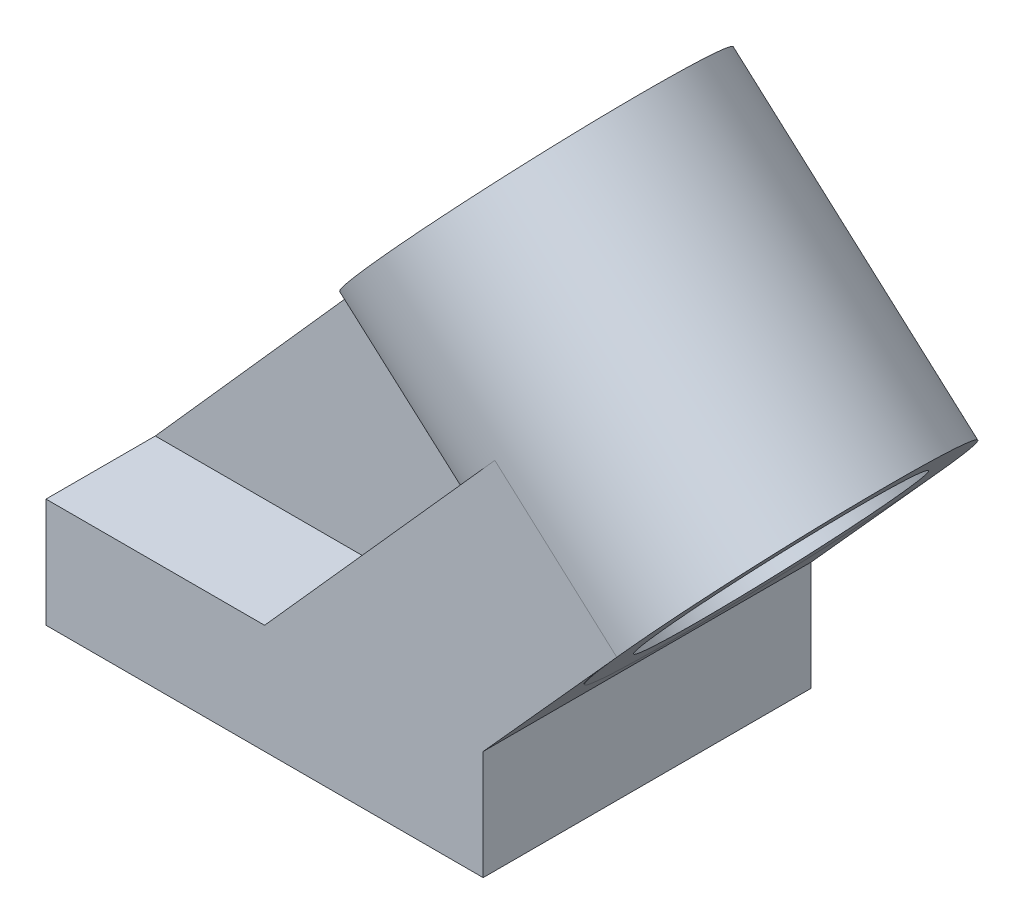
from build123d import *

# Parameters (mm, degrees)
SKETCH2_W                = 101.6
SKETCH2_H                = 25.4
BOSS_EXTRUDE1_DEPTH      = 76.2
BOSS_EXTRUDE2_DEPTH      = 76.2
BOSS_EXTRUDE7_DEPTH      = 38.1
BOSS_EXTRUDE7_DEPTH_BACK = 38.1
SKETCH11_R               = 38.1
SKETCH11_R_2             = 28.575
CUT_EXTRUDE2_DEPTH       = 38.1
RIB19_REACH              = 162.951
SKETCH13_WALL_W          = 399.99215347
SKETCH13_WALL_H          = 25.4


with BuildPart() as part:
    # Sketch2 → Boss-Extrude1 (new body)
    with BuildSketch(Plane.XY):
        with Locations((0, -12.7)):
            Rectangle(SKETCH2_W, SKETCH2_H)
    extrude(amount=BOSS_EXTRUDE1_DEPTH)

    # Sketch4 → Boss-Extrude2 (add)
    with BuildSketch(Plane.XY.offset(76.2)):
        Polygon((50.8, 0), (81.863189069, 34.499166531), (53.513191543, 59.953046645), (0, 0), align=None)
    extrude(amount=-BOSS_EXTRUDE2_DEPTH)

    # Sketch11 → Boss-Extrude7 (add, two sides: drawn at the far end of the back side and taken through both)
    with BuildSketch(Plane(origin=(0, 0, 0), x_dir=(0, 0, 1), z_dir=(-0.7460385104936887, 0.6659028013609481, 0)).offset(-BOSS_EXTRUDE7_DEPTH_BACK)):
        with Locations(Location((38.1, 80.361865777, 0), (0, 0, 270))):
            Circle(SKETCH11_R)
        with Locations(Location((38.1, 80.361865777, 0), (0, 0, 270))):
            Circle(SKETCH11_R_2, mode=Mode.SUBTRACT)
    extrude(amount=BOSS_EXTRUDE7_DEPTH + BOSS_EXTRUDE7_DEPTH_BACK)

    # Sketch12 → Cut-Extrude2 (cut)
    with BuildSketch(Plane(origin=(0, 0, 0), x_dir=(0, 0, 1), z_dir=(-0.7460385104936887, 0.6659028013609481, 0))):
        with BuildLine():
            Line((9.525, 80.361865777), (66.675, 80.361865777))
            ThreePointArc((66.675, 80.361865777), (38.1, 51.786865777), (9.525, 80.361865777))
        make_face()
    extrude(amount=-CUT_EXTRUDE2_DEPTH, mode=Mode.SUBTRACT)

    # Sketch13 wall → Rib19 (add, up to next)
    with BuildSketch(Plane(origin=(-25.53141153, 28.441481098, 38.1), x_dir=(0.664176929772, 0.747575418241, 0), z_dir=(-0.747575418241, 0.664176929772, 0)), mode=Mode.PRIVATE) as rib19_sk1:
        Rectangle(SKETCH13_WALL_W, SKETCH13_WALL_H)
    rib19_tool1 = extrude(rib19_sk1.sketch, amount=-RIB19_REACH, mode=Mode.PRIVATE) - part.part
    add(rib19_tool1.solids().sort_by_distance((-25.53141153, 28.441481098, 38.1))[0])


solid = part.part
